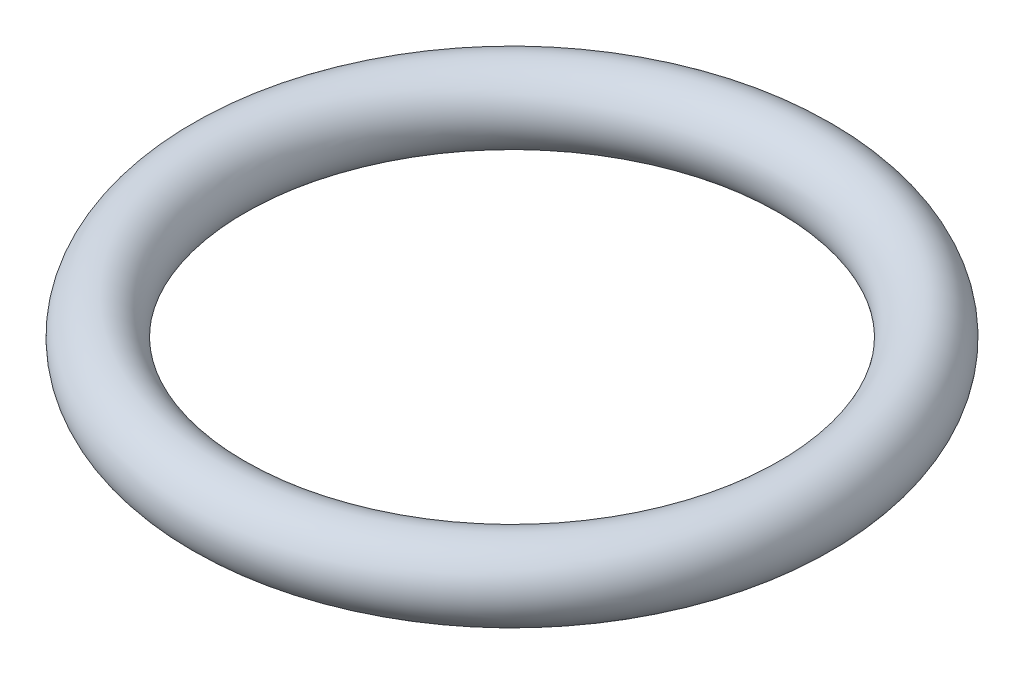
ISO-10303-21;
HEADER;
FILE_DESCRIPTION(('STEP AP214'),'2;1');
FILE_NAME('part.step','',(''),(''),'','','');
FILE_SCHEMA(('AUTOMOTIVE_DESIGN { 1 0 10303 214 1 1 1 1 }'));
ENDSEC;
DATA;
#1=APPLICATION_CONTEXT('core data for automotive mechanical design processes');
#2=APPLICATION_PROTOCOL_DEFINITION('international standard','automotive_design',2000,#1);
#3=PRODUCT_CONTEXT('',#1,'mechanical');
#4=PRODUCT('Part','Part','',(#3));
#5=PRODUCT_RELATED_PRODUCT_CATEGORY('part','',(#4));
#6=PRODUCT_DEFINITION_FORMATION('','',#4);
#7=PRODUCT_DEFINITION_CONTEXT('part definition',#1,'design');
#8=PRODUCT_DEFINITION('design','',#6,#7);
#9=PRODUCT_DEFINITION_SHAPE('','',#8);
#10=(LENGTH_UNIT() NAMED_UNIT(*) SI_UNIT(.MILLI.,.METRE.));
#11=(NAMED_UNIT(*) PLANE_ANGLE_UNIT() SI_UNIT($,.RADIAN.));
#12=(NAMED_UNIT(*) SI_UNIT($,.STERADIAN.) SOLID_ANGLE_UNIT());
#13=UNCERTAINTY_MEASURE_WITH_UNIT(LENGTH_MEASURE(1.E-05),#10,'distance_accuracy_value','');
#14=(GEOMETRIC_REPRESENTATION_CONTEXT(3) GLOBAL_UNCERTAINTY_ASSIGNED_CONTEXT((#13)) GLOBAL_UNIT_ASSIGNED_CONTEXT((#10,
#11,#12)) REPRESENTATION_CONTEXT('',''));
#15=CARTESIAN_POINT('',(0.,0.,0.));
#16=DIRECTION('',(0.,0.,1.));
#17=DIRECTION('',(1.,0.,0.));
#18=AXIS2_PLACEMENT_3D('',#15,#16,#17);
#19=CARTESIAN_POINT('',(0.,0.,0.));
#20=DIRECTION('',(0.,1.,0.));
#21=DIRECTION('',(0.,0.,1.));
#22=AXIS2_PLACEMENT_3D('',#19,#20,#21);
#23=TOROIDAL_SURFACE('',#22,8.,0.999999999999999);
#24=CARTESIAN_POINT('',(0.,0.,9.));
#25=VERTEX_POINT('',#24);
#26=VERTEX_LOOP('',#25);
#27=FACE_BOUND('',#26,.T.);
#28=ADVANCED_FACE('F29',(#27),#23,.T.);
#29=CLOSED_SHELL('',(#28));
#30=MANIFOLD_SOLID_BREP('B2',#29);
#31=ADVANCED_BREP_SHAPE_REPRESENTATION('',(#18,#30),#14);
#32=SHAPE_DEFINITION_REPRESENTATION(#9,#31);
ENDSEC;
END-ISO-10303-21;
